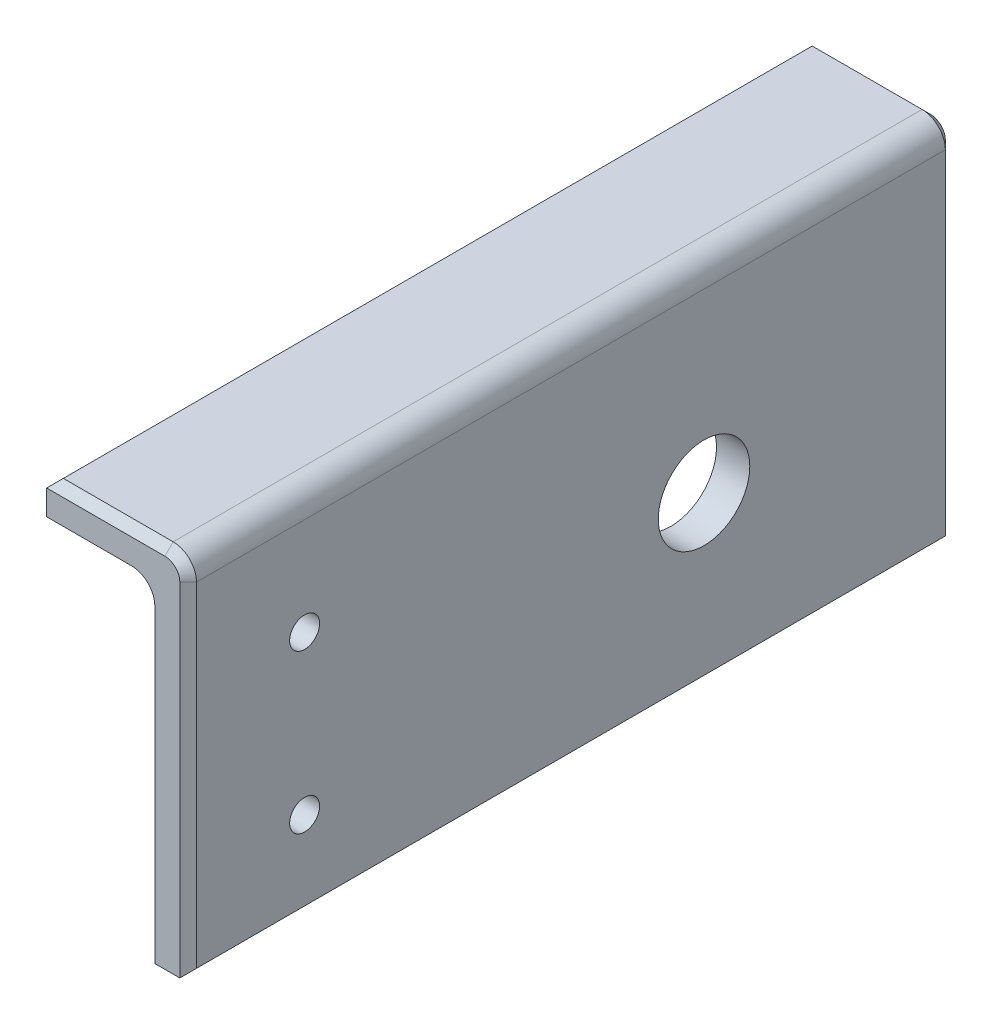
from build123d import *

# Parameters (mm, degrees)
SKETCH1_W           = 46
SKETCH1_H           = 20
BOSS_EXTRUDE1_DEPTH = 2
SKETCH2_R           = 0.9
SKETCH2_R_2         = 2.75
CUT_EXTRUDE1_DEPTH  = 10
SKETCH3_W           = 8.5
SKETCH3_H           = 46
BOSS_EXTRUDE2_DEPTH = 2
FILLET1_R           = 1.4
FILLET2_R           = 1.4
CHAMFER1_SIZE       = 0.5


with BuildPart() as part:
    # Sketch1 → Boss-Extrude1 (new body)
    with BuildSketch(Plane(origin=(0, 0, 0), x_dir=(0, 0, -1), z_dir=(1, 0, 0))):
        with Locations((-23, 10)):
            Rectangle(SKETCH1_W, SKETCH1_H)
    extrude(amount=BOSS_EXTRUDE1_DEPTH)

    # Sketch2 → Cut-Extrude1 (cut)
    with BuildSketch(Plane(origin=(2, 0, 0), x_dir=(0, 0, -1), z_dir=(1, 0, 0))):
        with Locations((-39, 14.75)):
            Circle(SKETCH2_R)
        with Locations((-39, 5.25)):
            Circle(SKETCH2_R)
        with Locations((-15, 10)):
            Circle(SKETCH2_R_2)
    extrude(amount=-CUT_EXTRUDE1_DEPTH, mode=Mode.SUBTRACT)

    # Sketch3 → Boss-Extrude2 (add)
    with BuildSketch(Plane(origin=(0, 20, 0), x_dir=(1, 0, 0), z_dir=(0, 1, 0))):
        with Locations((-2.25, -23)):
            Rectangle(SKETCH3_W, SKETCH3_H)
    extrude(amount=BOSS_EXTRUDE2_DEPTH)

    # Fillet1
    fillet1_edges = [part.edges().sort_by_distance(p)[0] for p in [
        (0, 20, 23),
    ]]
    fillet(fillet1_edges, radius=FILLET1_R)

    # Fillet2
    fillet2_edges = [part.edges().sort_by_distance(p)[0] for p in [
        (2, 22, 23),
    ]]
    fillet(fillet2_edges, radius=FILLET2_R)

    # Chamfer1
    chamfer1_edges = [part.edges().sort_by_distance(p)[0] for p in [
        (2, 0, 23),
        (-6.5, 22, 23),
        (-2.95, 22, 46),
        (-2.95, 22, 0),
        (2, 10.3, 0),
        (1.589949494, 21.589949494, 0),
        (2, 10.3, 46),
        (1.589949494, 21.589949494, 46),
    ]]
    chamfer(chamfer1_edges, length=CHAMFER1_SIZE)


solid = part.part
